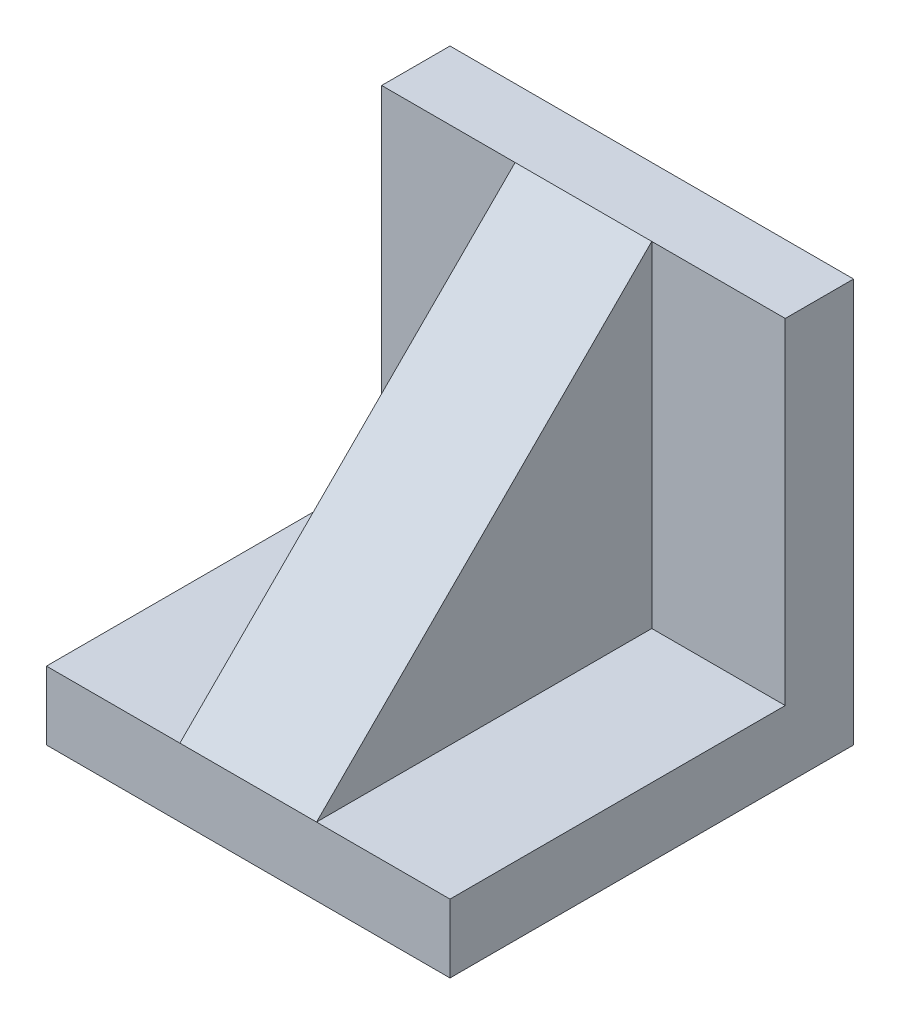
from build123d import *

# Parameters (mm, degrees)
BOSS_EXTRUDE1_DEPTH      = 75
BOSS_EXTRUDE1_DEPTH_BACK = 75
BOSS_EXTRUDE2_DEPTH      = 25.4
BOSS_EXTRUDE2_DEPTH_BACK = 25.4


with BuildPart() as part:
    # Sketch1 → Boss-Extrude1 (new, two sides: drawn at the far end of the back side and taken through both)
    with BuildSketch(Plane.YZ.offset(-BOSS_EXTRUDE1_DEPTH_BACK)):
        Polygon((0, 0), (0, 150), (25.4, 150), (25.4, 25.4), (150, 25.4), (150, 0), align=None)
    extrude(amount=BOSS_EXTRUDE1_DEPTH + BOSS_EXTRUDE1_DEPTH_BACK)

    # Sketch3 → Boss-Extrude2 (add, two sides: drawn at the far end of the back side and taken through both)
    with BuildSketch(Plane.YZ.offset(-BOSS_EXTRUDE2_DEPTH_BACK)):
        Polygon((0, 150), (25.4, 150), (150, 25.4), (150, 0), (0, 0), align=None)
    extrude(amount=BOSS_EXTRUDE2_DEPTH + BOSS_EXTRUDE2_DEPTH_BACK)


solid = part.part
